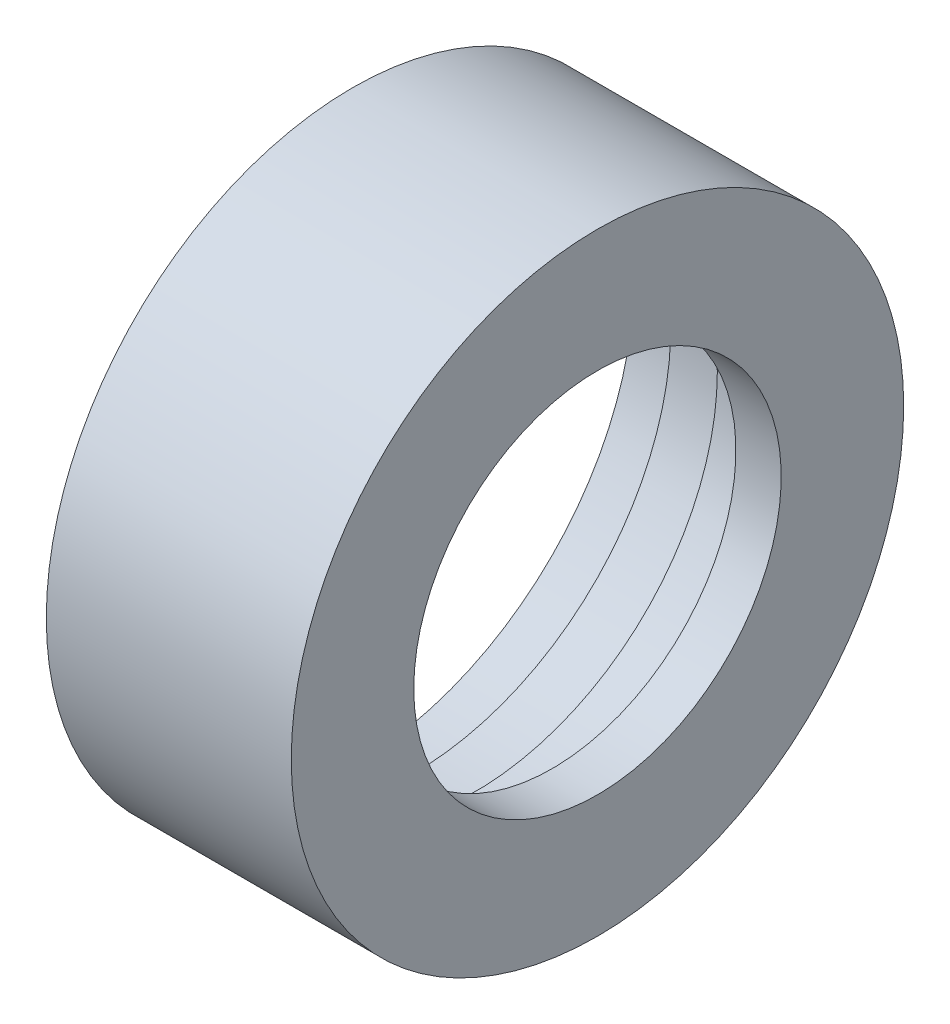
ISO-10303-21;
HEADER;
FILE_DESCRIPTION(('STEP AP214'),'2;1');
FILE_NAME('part.step','',(''),(''),'','','');
FILE_SCHEMA(('AUTOMOTIVE_DESIGN { 1 0 10303 214 1 1 1 1 }'));
ENDSEC;
DATA;
#1=APPLICATION_CONTEXT('core data for automotive mechanical design processes');
#2=APPLICATION_PROTOCOL_DEFINITION('international standard','automotive_design',2000,#1);
#3=PRODUCT_CONTEXT('',#1,'mechanical');
#4=PRODUCT('Part','Part','',(#3));
#5=PRODUCT_RELATED_PRODUCT_CATEGORY('part','',(#4));
#6=PRODUCT_DEFINITION_FORMATION('','',#4);
#7=PRODUCT_DEFINITION_CONTEXT('part definition',#1,'design');
#8=PRODUCT_DEFINITION('design','',#6,#7);
#9=PRODUCT_DEFINITION_SHAPE('','',#8);
#10=(LENGTH_UNIT() NAMED_UNIT(*) SI_UNIT(.MILLI.,.METRE.));
#11=(NAMED_UNIT(*) PLANE_ANGLE_UNIT() SI_UNIT($,.RADIAN.));
#12=(NAMED_UNIT(*) SI_UNIT($,.STERADIAN.) SOLID_ANGLE_UNIT());
#13=UNCERTAINTY_MEASURE_WITH_UNIT(LENGTH_MEASURE(1.E-05),#10,'distance_accuracy_value','');
#14=(GEOMETRIC_REPRESENTATION_CONTEXT(3) GLOBAL_UNCERTAINTY_ASSIGNED_CONTEXT((#13)) GLOBAL_UNIT_ASSIGNED_CONTEXT((#10,
#11,#12)) REPRESENTATION_CONTEXT('',''));
#15=CARTESIAN_POINT('',(0.,0.,0.));
#16=DIRECTION('',(0.,0.,1.));
#17=DIRECTION('',(1.,0.,0.));
#18=AXIS2_PLACEMENT_3D('',#15,#16,#17);
#19=CARTESIAN_POINT('',(-269.291808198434,0.,0.));
#20=DIRECTION('',(-1.,0.,0.));
#21=DIRECTION('',(0.,0.,1.));
#22=AXIS2_PLACEMENT_3D('',#19,#20,#21);
#23=CONICAL_SURFACE('',#22,25.0000000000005,1.40494581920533);
#24=CARTESIAN_POINT('',(-268.295849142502,0.,0.));
#25=DIRECTION('',(-1.,0.,0.));
#26=DIRECTION('',(0.,0.,1.));
#27=AXIS2_PLACEMENT_3D('',#24,#25,#26);
#28=CIRCLE('',#27,19.05);
#29=CARTESIAN_POINT('',(-268.295849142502,0.,19.05));
#30=VERTEX_POINT('',#29);
#31=EDGE_CURVE('E10',#30,#30,#28,.T.);
#32=ORIENTED_EDGE('',*,*,#31,.F.);
#33=EDGE_LOOP('',(#32));
#34=FACE_BOUND('',#33,.T.);
#35=CARTESIAN_POINT('',(-269.312731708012,0.,0.));
#36=DIRECTION('',(-1.,0.,0.));
#37=DIRECTION('',(0.,0.,1.));
#38=AXIS2_PLACEMENT_3D('',#35,#36,#37);
#39=CIRCLE('',#38,25.125);
#40=CARTESIAN_POINT('',(-269.312731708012,0.,25.125));
#41=VERTEX_POINT('',#40);
#42=EDGE_CURVE('E62',#41,#41,#39,.T.);
#43=ORIENTED_EDGE('',*,*,#42,.T.);
#44=EDGE_LOOP('',(#43));
#45=FACE_BOUND('',#44,.T.);
#46=ADVANCED_FACE('F28',(#34,#45),#23,.F.);
#47=CARTESIAN_POINT('',(-300.737709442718,0.,0.));
#48=DIRECTION('',(-1.,0.,0.));
#49=DIRECTION('',(0.,0.,1.));
#50=AXIS2_PLACEMENT_3D('',#47,#48,#49);
#51=CYLINDRICAL_SURFACE('',#50,19.05);
#52=CARTESIAN_POINT('',(-263.596564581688,0.,0.));
#53=DIRECTION('',(-1.,0.,0.));
#54=DIRECTION('',(0.,0.,1.));
#55=AXIS2_PLACEMENT_3D('',#52,#53,#54);
#56=CIRCLE('',#55,19.05);
#57=CARTESIAN_POINT('',(-263.596564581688,0.,19.05));
#58=VERTEX_POINT('',#57);
#59=EDGE_CURVE('E34',#58,#58,#56,.T.);
#60=ORIENTED_EDGE('',*,*,#59,.F.);
#61=EDGE_LOOP('',(#60));
#62=FACE_BOUND('',#61,.T.);
#63=ORIENTED_EDGE('',*,*,#31,.T.);
#64=EDGE_LOOP('',(#63));
#65=FACE_BOUND('',#64,.T.);
#66=ADVANCED_FACE('F111',(#62,#65),#51,.F.);
#67=CARTESIAN_POINT('',(-263.596564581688,19.05,0.));
#68=DIRECTION('',(-1.,0.,0.));
#69=DIRECTION('',(0.,0.,1.));
#70=AXIS2_PLACEMENT_3D('',#67,#68,#69);
#71=PLANE('',#70);
#72=CARTESIAN_POINT('',(-263.596564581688,0.,0.));
#73=DIRECTION('',(-1.,0.,0.));
#74=DIRECTION('',(0.,0.,1.));
#75=AXIS2_PLACEMENT_3D('',#72,#73,#74);
#76=CIRCLE('',#75,31.75);
#77=CARTESIAN_POINT('',(-263.596564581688,0.,31.75));
#78=VERTEX_POINT('',#77);
#79=EDGE_CURVE('E38',#78,#78,#76,.T.);
#80=ORIENTED_EDGE('',*,*,#79,.F.);
#81=EDGE_LOOP('',(#80));
#82=FACE_BOUND('',#81,.T.);
#83=ORIENTED_EDGE('',*,*,#59,.T.);
#84=EDGE_LOOP('',(#83));
#85=FACE_BOUND('',#84,.T.);
#86=ADVANCED_FACE('F106',(#82,#85),#71,.F.);
#87=CARTESIAN_POINT('',(-300.737709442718,0.,0.));
#88=DIRECTION('',(-1.,0.,0.));
#89=DIRECTION('',(0.,0.,1.));
#90=AXIS2_PLACEMENT_3D('',#87,#88,#89);
#91=CYLINDRICAL_SURFACE('',#90,31.75);
#92=CARTESIAN_POINT('',(-288.996564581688,0.,0.));
#93=DIRECTION('',(-1.,0.,0.));
#94=DIRECTION('',(0.,0.,1.));
#95=AXIS2_PLACEMENT_3D('',#92,#93,#94);
#96=CIRCLE('',#95,31.75);
#97=CARTESIAN_POINT('',(-288.996564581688,0.,31.75));
#98=VERTEX_POINT('',#97);
#99=EDGE_CURVE('E42',#98,#98,#96,.T.);
#100=ORIENTED_EDGE('',*,*,#99,.F.);
#101=EDGE_LOOP('',(#100));
#102=FACE_BOUND('',#101,.T.);
#103=ORIENTED_EDGE('',*,*,#79,.T.);
#104=EDGE_LOOP('',(#103));
#105=FACE_BOUND('',#104,.T.);
#106=ADVANCED_FACE('F100',(#102,#105),#91,.T.);
#107=CARTESIAN_POINT('',(-288.996564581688,31.75,0.));
#108=DIRECTION('',(1.,0.,0.));
#109=DIRECTION('',(0.,0.,-1.));
#110=AXIS2_PLACEMENT_3D('',#107,#108,#109);
#111=PLANE('',#110);
#112=CARTESIAN_POINT('',(-288.996564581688,0.,0.));
#113=DIRECTION('',(-1.,0.,0.));
#114=DIRECTION('',(0.,0.,1.));
#115=AXIS2_PLACEMENT_3D('',#112,#113,#114);
#116=CIRCLE('',#115,29.2);
#117=CARTESIAN_POINT('',(-288.996564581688,0.,29.2));
#118=VERTEX_POINT('',#117);
#119=EDGE_CURVE('E47',#118,#118,#116,.T.);
#120=ORIENTED_EDGE('',*,*,#119,.F.);
#121=EDGE_LOOP('',(#120));
#122=FACE_BOUND('',#121,.T.);
#123=ORIENTED_EDGE('',*,*,#99,.T.);
#124=EDGE_LOOP('',(#123));
#125=FACE_BOUND('',#124,.T.);
#126=ADVANCED_FACE('F94',(#122,#125),#111,.F.);
#127=CARTESIAN_POINT('',(-300.737709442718,0.,0.));
#128=DIRECTION('',(-1.,0.,0.));
#129=DIRECTION('',(0.,0.,1.));
#130=AXIS2_PLACEMENT_3D('',#127,#128,#129);
#131=CYLINDRICAL_SURFACE('',#130,29.2);
#132=CARTESIAN_POINT('',(-282.696564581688,0.,0.));
#133=DIRECTION('',(-1.,0.,0.));
#134=DIRECTION('',(0.,0.,1.));
#135=AXIS2_PLACEMENT_3D('',#132,#133,#134);
#136=CIRCLE('',#135,29.2);
#137=CARTESIAN_POINT('',(-282.696564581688,0.,29.2));
#138=VERTEX_POINT('',#137);
#139=EDGE_CURVE('E50',#138,#138,#136,.T.);
#140=ORIENTED_EDGE('',*,*,#139,.F.);
#141=EDGE_LOOP('',(#140));
#142=FACE_BOUND('',#141,.T.);
#143=ORIENTED_EDGE('',*,*,#119,.T.);
#144=EDGE_LOOP('',(#143));
#145=FACE_BOUND('',#144,.T.);
#146=ADVANCED_FACE('F88',(#142,#145),#131,.F.);
#147=CARTESIAN_POINT('',(-282.696564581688,29.2,0.));
#148=DIRECTION('',(1.,0.,0.));
#149=DIRECTION('',(0.,0.,-1.));
#150=AXIS2_PLACEMENT_3D('',#147,#148,#149);
#151=PLANE('',#150);
#152=CARTESIAN_POINT('',(-282.696564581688,0.,0.));
#153=DIRECTION('',(-1.,0.,0.));
#154=DIRECTION('',(0.,0.,1.));
#155=AXIS2_PLACEMENT_3D('',#152,#153,#154);
#156=CIRCLE('',#155,26.7);
#157=CARTESIAN_POINT('',(-282.696564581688,0.,26.7));
#158=VERTEX_POINT('',#157);
#159=EDGE_CURVE('E53',#158,#158,#156,.T.);
#160=ORIENTED_EDGE('',*,*,#159,.F.);
#161=EDGE_LOOP('',(#160));
#162=FACE_BOUND('',#161,.T.);
#163=ORIENTED_EDGE('',*,*,#139,.T.);
#164=EDGE_LOOP('',(#163));
#165=FACE_BOUND('',#164,.T.);
#166=ADVANCED_FACE('F82',(#162,#165),#151,.F.);
#167=CARTESIAN_POINT('',(-300.737709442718,0.,0.));
#168=DIRECTION('',(-1.,0.,0.));
#169=DIRECTION('',(0.,0.,1.));
#170=AXIS2_PLACEMENT_3D('',#167,#168,#169);
#171=CYLINDRICAL_SURFACE('',#170,26.7);
#172=CARTESIAN_POINT('',(-276.296564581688,0.,0.));
#173=DIRECTION('',(-1.,0.,0.));
#174=DIRECTION('',(0.,0.,1.));
#175=AXIS2_PLACEMENT_3D('',#172,#173,#174);
#176=CIRCLE('',#175,26.7);
#177=CARTESIAN_POINT('',(-276.296564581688,0.,26.7));
#178=VERTEX_POINT('',#177);
#179=EDGE_CURVE('E56',#178,#178,#176,.T.);
#180=ORIENTED_EDGE('',*,*,#179,.F.);
#181=EDGE_LOOP('',(#180));
#182=FACE_BOUND('',#181,.T.);
#183=ORIENTED_EDGE('',*,*,#159,.T.);
#184=EDGE_LOOP('',(#183));
#185=FACE_BOUND('',#184,.T.);
#186=ADVANCED_FACE('F76',(#182,#185),#171,.F.);
#187=CARTESIAN_POINT('',(-276.296564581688,26.7,0.));
#188=DIRECTION('',(1.,0.,0.));
#189=DIRECTION('',(0.,0.,-1.));
#190=AXIS2_PLACEMENT_3D('',#187,#188,#189);
#191=PLANE('',#190);
#192=CARTESIAN_POINT('',(-276.296564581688,0.,0.));
#193=DIRECTION('',(-1.,0.,0.));
#194=DIRECTION('',(0.,0.,1.));
#195=AXIS2_PLACEMENT_3D('',#192,#193,#194);
#196=CIRCLE('',#195,25.1249999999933);
#197=CARTESIAN_POINT('',(-276.296564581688,0.,25.1249999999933));
#198=VERTEX_POINT('',#197);
#199=EDGE_CURVE('E59',#198,#198,#196,.T.);
#200=ORIENTED_EDGE('',*,*,#199,.F.);
#201=EDGE_LOOP('',(#200));
#202=FACE_BOUND('',#201,.T.);
#203=ORIENTED_EDGE('',*,*,#179,.T.);
#204=EDGE_LOOP('',(#203));
#205=FACE_BOUND('',#204,.T.);
#206=ADVANCED_FACE('F70',(#202,#205),#191,.F.);
#207=CARTESIAN_POINT('',(-300.737709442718,0.,0.));
#208=DIRECTION('',(-1.,0.,0.));
#209=DIRECTION('',(0.,0.,1.));
#210=AXIS2_PLACEMENT_3D('',#207,#208,#209);
#211=CYLINDRICAL_SURFACE('',#210,25.1249999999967);
#212=ORIENTED_EDGE('',*,*,#42,.F.);
#213=EDGE_LOOP('',(#212));
#214=FACE_BOUND('',#213,.T.);
#215=ORIENTED_EDGE('',*,*,#199,.T.);
#216=EDGE_LOOP('',(#215));
#217=FACE_BOUND('',#216,.T.);
#218=ADVANCED_FACE('F67',(#214,#217),#211,.F.);
#219=CLOSED_SHELL('',(#46,#66,#86,#106,#126,#146,#166,#186,#206,#218));
#220=MANIFOLD_SOLID_BREP('B2',#219);
#221=ADVANCED_BREP_SHAPE_REPRESENTATION('',(#18,#220),#14);
#222=SHAPE_DEFINITION_REPRESENTATION(#9,#221);
ENDSEC;
END-ISO-10303-21;
